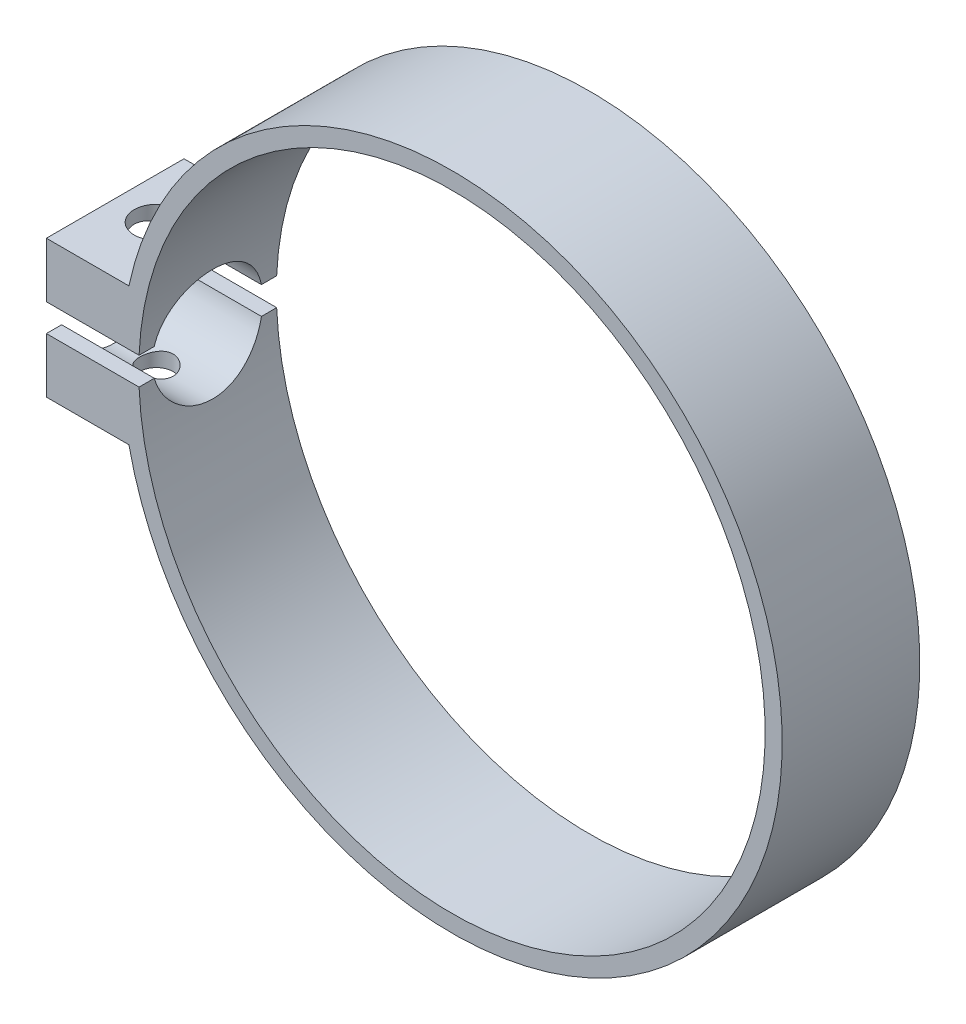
from build123d import *

# Parameters (mm, degrees)
BOSS_EXTRUDE1_DEPTH     = 15.875
CUT_EXTRUDE1_REACH      = 96.392
CUT_EXTRUDE1_END_RADIUS = 36.1315
CUT_EXTRUDE2_REACH      = 69.533
CUT_EXTRUDE2_END_RADIUS = 6.35
SKETCH3_R               = 2.5527
CUT_EXTRUDE3_DEPTH      = 68.53279251


with BuildPart() as part:
    # Sketch1 → Boss-Extrude1 (new body)
    with BuildSketch(Plane.XY):
        with BuildLine():
            Line((-37.264005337, 7.9375), (-46.789005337, 7.9375))
            Line((-46.789005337, 7.9375), (-46.789005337, 1.5875))
            Line((-46.789005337, 1.5875), (-36.096608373, 1.5875))
            ThreePointArc((-36.096608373, 1.5875), (36.1315, 0), (-36.096608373, -1.5875))
            Line((-36.096608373, -1.5875), (-46.789005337, -1.5875))
            Line((-46.789005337, -1.5875), (-46.789005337, -7.9375))
            Line((-46.789005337, -7.9375), (-37.264005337, -7.9375))
            ThreePointArc((-37.264005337, -7.9375), (38.1, 0), (-37.264005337, 7.9375))
        make_face()
    extrude(amount=BOSS_EXTRUDE1_DEPTH)

    # Cut-Extrude1: up to this cylinder (the profile starts outside it)
    cut_extrude1_end = Plane(origin=(0, 0, 7.9375), z_dir=(0, 0, -1)) * Cylinder(CUT_EXTRUDE1_END_RADIUS, 266.047, mode=Mode.PRIVATE)
    # Sketch2 → Cut-Extrude1 (cut, up to the surface)
    with BuildSketch(Plane.ZY.offset(46.789005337), mode=Mode.PRIVATE) as cut_extrude1_sk1:
        with BuildLine():
            Line((14.2875, 0.127), (14.2875, -0.127))
            ThreePointArc((14.2875, -0.127), (7.9375, -6.477), (1.5875, -0.127))
            Line((1.5875, -0.127), (1.5875, 0.127))
            ThreePointArc((1.5875, 0.127), (7.9375, 6.477), (14.2875, 0.127))
        make_face()
    cut_extrude1_tool1 = extrude(cut_extrude1_sk1.sketch, amount=-CUT_EXTRUDE1_REACH, mode=Mode.PRIVATE) - cut_extrude1_end
    add(cut_extrude1_tool1.solids().sort_by_distance((-46.789005, 0, 7.9375))[0], mode=Mode.SUBTRACT)

    # Cut-Extrude2: up to this cylinder (the profile starts outside it)
    cut_extrude2_end = Plane(origin=(-42.026505, 0.127, 7.9375), z_dir=(-1, 0, 0)) * Cylinder(CUT_EXTRUDE2_END_RADIUS, 152.766, mode=Mode.PRIVATE)
    # Sketch3 → Cut-Extrude2 (cut, up to the surface)
    with BuildSketch(Plane(origin=(0, 7.9375, 0), x_dir=(1, 0, 0), z_dir=(0, 1, 0)), mode=Mode.PRIVATE) as cut_extrude2_sk1:
        with Locations(Location((-42.026505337, -7.9375, 0), (0, 0, 180))):
            Circle(SKETCH3_R)
    cut_extrude2_tool1 = extrude(cut_extrude2_sk1.sketch, amount=-CUT_EXTRUDE2_REACH, mode=Mode.PRIVATE) - cut_extrude2_end
    add(cut_extrude2_tool1.solids().sort_by_distance((-42.026505, 7.9375, 7.9375))[0], mode=Mode.SUBTRACT)

    # Sketch3_3 → Cut-Extrude3 (cut, through all)
    with BuildSketch(Plane(origin=(0, 7.9375, 0), x_dir=(1, 0, 0), z_dir=(0, 1, 0))):
        with BuildLine():
            ThreePointArc((-43.953095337, -7.9375), (-42.026505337, -9.86409), (-40.099915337, -7.9375))
            Line((-40.099915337, -7.9375), (-43.953095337, -7.9375))
        make_face()
        with BuildLine():
            Line((-43.953095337, -7.9375), (-40.099915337, -7.9375))
            ThreePointArc((-40.099915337, -7.9375), (-42.026505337, -6.01091), (-43.953095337, -7.9375))
        make_face()
        with BuildLine():
            ThreePointArc((-43.953095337, -7.9375), (-42.026505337, -9.86409), (-40.099915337, -7.9375))
            Line((-40.099915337, -7.9375), (-43.953095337, -7.9375))
        make_face()
        with BuildLine():
            Line((-43.953095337, -7.9375), (-40.099915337, -7.9375))
            ThreePointArc((-40.099915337, -7.9375), (-42.026505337, -6.01091), (-43.953095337, -7.9375))
        make_face()
    extrude(amount=-CUT_EXTRUDE3_DEPTH, mode=Mode.SUBTRACT)


solid = part.part
